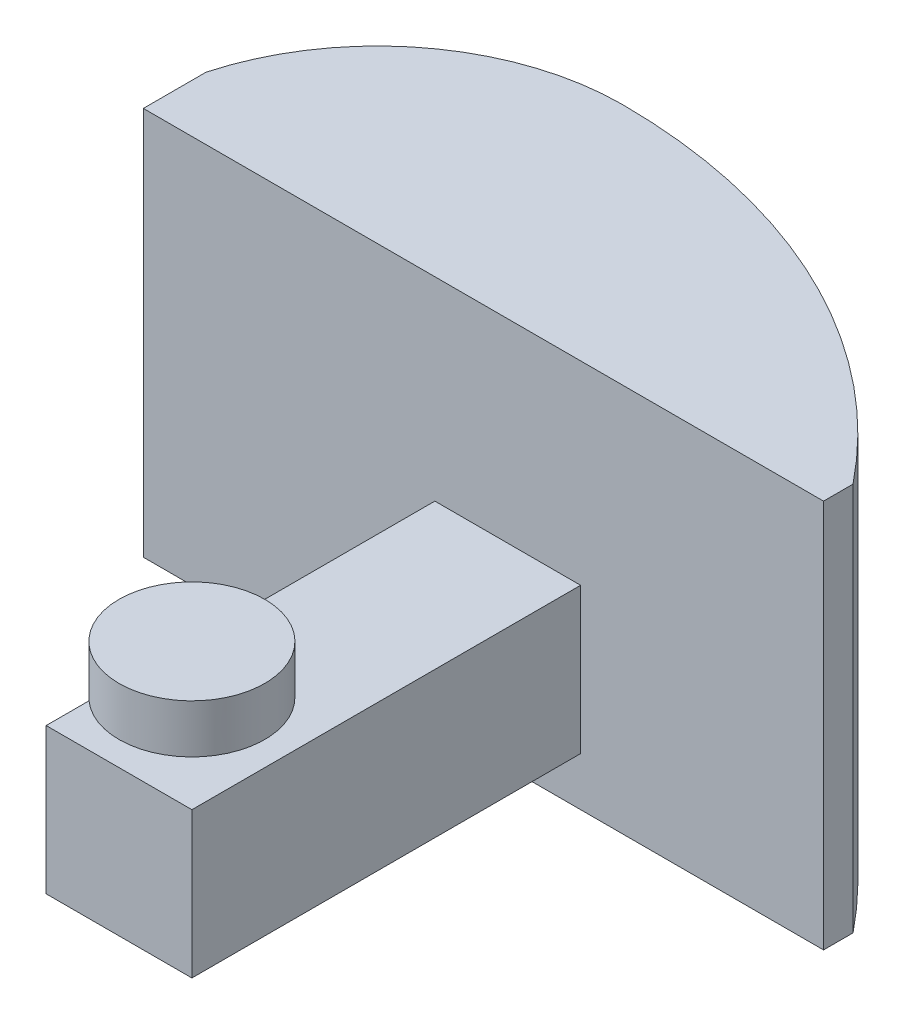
ISO-10303-21;
HEADER;
FILE_DESCRIPTION(('STEP AP214'),'2;1');
FILE_NAME('part.step','',(''),(''),'','','');
FILE_SCHEMA(('AUTOMOTIVE_DESIGN { 1 0 10303 214 1 1 1 1 }'));
ENDSEC;
DATA;
#1=APPLICATION_CONTEXT('core data for automotive mechanical design processes');
#2=APPLICATION_PROTOCOL_DEFINITION('international standard','automotive_design',2000,#1);
#3=PRODUCT_CONTEXT('',#1,'mechanical');
#4=PRODUCT('Part','Part','',(#3));
#5=PRODUCT_RELATED_PRODUCT_CATEGORY('part','',(#4));
#6=PRODUCT_DEFINITION_FORMATION('','',#4);
#7=PRODUCT_DEFINITION_CONTEXT('part definition',#1,'design');
#8=PRODUCT_DEFINITION('design','',#6,#7);
#9=PRODUCT_DEFINITION_SHAPE('','',#8);
#10=(LENGTH_UNIT() NAMED_UNIT(*) SI_UNIT(.MILLI.,.METRE.));
#11=(NAMED_UNIT(*) PLANE_ANGLE_UNIT() SI_UNIT($,.RADIAN.));
#12=(NAMED_UNIT(*) SI_UNIT($,.STERADIAN.) SOLID_ANGLE_UNIT());
#13=UNCERTAINTY_MEASURE_WITH_UNIT(LENGTH_MEASURE(1.E-05),#10,'distance_accuracy_value','');
#14=(GEOMETRIC_REPRESENTATION_CONTEXT(3) GLOBAL_UNCERTAINTY_ASSIGNED_CONTEXT((#13)) GLOBAL_UNIT_ASSIGNED_CONTEXT((#10,
#11,#12)) REPRESENTATION_CONTEXT('',''));
#15=CARTESIAN_POINT('',(0.,0.,0.));
#16=DIRECTION('',(0.,0.,1.));
#17=DIRECTION('',(1.,0.,0.));
#18=AXIS2_PLACEMENT_3D('',#15,#16,#17);
#19=CARTESIAN_POINT('',(-9.00000000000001,20.,8.));
#20=DIRECTION('',(0.,-1.,0.));
#21=DIRECTION('',(0.,0.,-1.));
#22=AXIS2_PLACEMENT_3D('',#19,#20,#21);
#23=PLANE('',#22);
#24=CARTESIAN_POINT('',(-8.00000000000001,20.,6.));
#25=DIRECTION('',(0.,-1.,0.));
#26=DIRECTION('',(0.,0.,-1.));
#27=AXIS2_PLACEMENT_3D('',#24,#25,#26);
#28=CIRCLE('',#27,1.5);
#29=CARTESIAN_POINT('',(-9.00000000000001,20.,7.11803398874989));
#30=VERTEX_POINT('',#29);
#31=CARTESIAN_POINT('',(-9.00000000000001,20.,4.88196601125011));
#32=VERTEX_POINT('',#31);
#33=EDGE_CURVE('E11',#30,#32,#28,.F.);
#34=ORIENTED_EDGE('',*,*,#33,.F.);
#35=DIRECTION('',(0.,0.,-1.));
#36=VECTOR('',#35,1.);
#37=CARTESIAN_POINT('',(-9.00000000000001,20.,8.));
#38=LINE('',#37,#36);
#39=CARTESIAN_POINT('',(-9.00000000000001,20.,8.));
#40=VERTEX_POINT('',#39);
#41=EDGE_CURVE('E119',#40,#30,#38,.T.);
#42=ORIENTED_EDGE('',*,*,#41,.F.);
#43=DIRECTION('',(-1.,0.,0.));
#44=VECTOR('',#43,1.);
#45=CARTESIAN_POINT('',(-9.00000000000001,20.,8.));
#46=LINE('',#45,#44);
#47=CARTESIAN_POINT('',(-6.00000000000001,20.,8.));
#48=VERTEX_POINT('',#47);
#49=EDGE_CURVE('E127',#48,#40,#46,.T.);
#50=ORIENTED_EDGE('',*,*,#49,.F.);
#51=DIRECTION('',(0.,0.,-1.));
#52=VECTOR('',#51,1.);
#53=CARTESIAN_POINT('',(-6.00000000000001,20.,8.));
#54=LINE('',#53,#52);
#55=CARTESIAN_POINT('',(-6.00000000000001,20.,0.));
#56=VERTEX_POINT('',#55);
#57=EDGE_CURVE('E196',#48,#56,#54,.T.);
#58=ORIENTED_EDGE('',*,*,#57,.T.);
#59=DIRECTION('',(-1.,0.,0.));
#60=VECTOR('',#59,1.);
#61=CARTESIAN_POINT('',(-9.00000000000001,20.,0.));
#62=LINE('',#61,#60);
#63=CARTESIAN_POINT('',(-9.00000000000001,20.,0.));
#64=VERTEX_POINT('',#63);
#65=EDGE_CURVE('E126',#56,#64,#62,.T.);
#66=ORIENTED_EDGE('',*,*,#65,.T.);
#67=EDGE_CURVE('E116',#32,#64,#38,.T.);
#68=ORIENTED_EDGE('',*,*,#67,.F.);
#69=EDGE_LOOP('',(#34,#42,#50,#58,#66,#68));
#70=FACE_BOUND('',#69,.T.);
#71=ADVANCED_FACE('F32',(#70),#23,.F.);
#72=CARTESIAN_POINT('',(-9.00000000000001,20.,8.));
#73=DIRECTION('',(1.,0.,0.));
#74=DIRECTION('',(0.,0.,-1.));
#75=AXIS2_PLACEMENT_3D('',#72,#73,#74);
#76=PLANE('',#75);
#77=DIRECTION('',(0.,-1.,0.));
#78=VECTOR('',#77,1.);
#79=CARTESIAN_POINT('',(-9.00000000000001,20.,0.));
#80=LINE('',#79,#78);
#81=CARTESIAN_POINT('',(-9.00000000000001,17.,0.));
#82=VERTEX_POINT('',#81);
#83=EDGE_CURVE('E179',#64,#82,#80,.T.);
#84=ORIENTED_EDGE('',*,*,#83,.T.);
#85=DIRECTION('',(0.,0.,-1.));
#86=VECTOR('',#85,1.);
#87=CARTESIAN_POINT('',(-9.00000000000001,17.,8.));
#88=LINE('',#87,#86);
#89=CARTESIAN_POINT('',(-9.00000000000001,17.,8.));
#90=VERTEX_POINT('',#89);
#91=EDGE_CURVE('E201',#90,#82,#88,.T.);
#92=ORIENTED_EDGE('',*,*,#91,.F.);
#93=DIRECTION('',(0.,-1.,0.));
#94=VECTOR('',#93,1.);
#95=CARTESIAN_POINT('',(-9.00000000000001,20.,8.));
#96=LINE('',#95,#94);
#97=EDGE_CURVE('E188',#40,#90,#96,.T.);
#98=ORIENTED_EDGE('',*,*,#97,.F.);
#99=ORIENTED_EDGE('',*,*,#41,.T.);
#100=EDGE_CURVE('E114',#30,#32,#38,.T.);
#101=ORIENTED_EDGE('',*,*,#100,.T.);
#102=ORIENTED_EDGE('',*,*,#67,.T.);
#103=EDGE_LOOP('',(#84,#92,#98,#99,#101,#102));
#104=FACE_BOUND('',#103,.T.);
#105=ADVANCED_FACE('F34',(#104),#76,.F.);
#106=CARTESIAN_POINT('',(-9.00000000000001,17.,8.));
#107=DIRECTION('',(0.,1.,0.));
#108=DIRECTION('',(0.,0.,1.));
#109=AXIS2_PLACEMENT_3D('',#106,#107,#108);
#110=PLANE('',#109);
#111=DIRECTION('',(1.,0.,0.));
#112=VECTOR('',#111,1.);
#113=CARTESIAN_POINT('',(-9.00000000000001,17.,0.));
#114=LINE('',#113,#112);
#115=CARTESIAN_POINT('',(-6.00000000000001,17.,0.));
#116=VERTEX_POINT('',#115);
#117=EDGE_CURVE('E181',#82,#116,#114,.T.);
#118=ORIENTED_EDGE('',*,*,#117,.T.);
#119=DIRECTION('',(0.,0.,-1.));
#120=VECTOR('',#119,1.);
#121=CARTESIAN_POINT('',(-6.00000000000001,17.,8.));
#122=LINE('',#121,#120);
#123=CARTESIAN_POINT('',(-6.00000000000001,17.,8.));
#124=VERTEX_POINT('',#123);
#125=EDGE_CURVE('E198',#124,#116,#122,.T.);
#126=ORIENTED_EDGE('',*,*,#125,.F.);
#127=DIRECTION('',(1.,0.,0.));
#128=VECTOR('',#127,1.);
#129=CARTESIAN_POINT('',(-9.00000000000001,17.,8.));
#130=LINE('',#129,#128);
#131=EDGE_CURVE('E191',#90,#124,#130,.T.);
#132=ORIENTED_EDGE('',*,*,#131,.F.);
#133=ORIENTED_EDGE('',*,*,#91,.T.);
#134=EDGE_LOOP('',(#118,#126,#132,#133));
#135=FACE_BOUND('',#134,.T.);
#136=ADVANCED_FACE('F237',(#135),#110,.F.);
#137=CARTESIAN_POINT('',(-6.00000000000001,20.,8.));
#138=DIRECTION('',(-1.,0.,0.));
#139=DIRECTION('',(0.,-1.,0.));
#140=AXIS2_PLACEMENT_3D('',#137,#138,#139);
#141=PLANE('',#140);
#142=DIRECTION('',(0.,1.,0.));
#143=VECTOR('',#142,1.);
#144=CARTESIAN_POINT('',(-6.00000000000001,20.,0.));
#145=LINE('',#144,#143);
#146=EDGE_CURVE('E184',#116,#56,#145,.T.);
#147=ORIENTED_EDGE('',*,*,#146,.T.);
#148=ORIENTED_EDGE('',*,*,#57,.F.);
#149=DIRECTION('',(0.,1.,0.));
#150=VECTOR('',#149,1.);
#151=CARTESIAN_POINT('',(-6.00000000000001,20.,8.));
#152=LINE('',#151,#150);
#153=EDGE_CURVE('E193',#124,#48,#152,.T.);
#154=ORIENTED_EDGE('',*,*,#153,.F.);
#155=ORIENTED_EDGE('',*,*,#125,.T.);
#156=EDGE_LOOP('',(#147,#148,#154,#155));
#157=FACE_BOUND('',#156,.T.);
#158=ADVANCED_FACE('F244',(#157),#141,.F.);
#159=CARTESIAN_POINT('',(-9.00000000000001,17.,8.));
#160=DIRECTION('',(0.,0.,1.));
#161=DIRECTION('',(1.,0.,0.));
#162=AXIS2_PLACEMENT_3D('',#159,#160,#161);
#163=PLANE('',#162);
#164=ORIENTED_EDGE('',*,*,#97,.T.);
#165=ORIENTED_EDGE('',*,*,#131,.T.);
#166=ORIENTED_EDGE('',*,*,#153,.T.);
#167=ORIENTED_EDGE('',*,*,#49,.T.);
#168=EDGE_LOOP('',(#164,#165,#166,#167));
#169=FACE_BOUND('',#168,.T.);
#170=ADVANCED_FACE('F233',(#169),#163,.T.);
#171=CARTESIAN_POINT('',(-15.,16.,0.));
#172=DIRECTION('',(0.,0.,1.));
#173=DIRECTION('',(1.,0.,0.));
#174=AXIS2_PLACEMENT_3D('',#171,#172,#173);
#175=PLANE('',#174);
#176=DIRECTION('',(0.,1.,0.));
#177=VECTOR('',#176,1.);
#178=CARTESIAN_POINT('',(-15.,24.,0.));
#179=LINE('',#178,#177);
#180=CARTESIAN_POINT('',(-15.,16.,0.));
#181=VERTEX_POINT('',#180);
#182=CARTESIAN_POINT('',(-15.,24.,0.));
#183=VERTEX_POINT('',#182);
#184=EDGE_CURVE('E149',#181,#183,#179,.T.);
#185=ORIENTED_EDGE('',*,*,#184,.F.);
#186=DIRECTION('',(-1.,0.,0.));
#187=VECTOR('',#186,1.);
#188=CARTESIAN_POINT('',(-15.,16.,0.));
#189=LINE('',#188,#187);
#190=CARTESIAN_POINT('',(-1.00000000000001,16.,0.));
#191=VERTEX_POINT('',#190);
#192=EDGE_CURVE('E162',#191,#181,#189,.T.);
#193=ORIENTED_EDGE('',*,*,#192,.F.);
#194=DIRECTION('',(0.,-1.,0.));
#195=VECTOR('',#194,1.);
#196=CARTESIAN_POINT('',(-1.00000000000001,24.,0.));
#197=LINE('',#196,#195);
#198=CARTESIAN_POINT('',(-1.00000000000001,24.,0.));
#199=VERTEX_POINT('',#198);
#200=EDGE_CURVE('E159',#199,#191,#197,.T.);
#201=ORIENTED_EDGE('',*,*,#200,.F.);
#202=DIRECTION('',(1.,0.,0.));
#203=VECTOR('',#202,1.);
#204=CARTESIAN_POINT('',(-15.,24.,0.));
#205=LINE('',#204,#203);
#206=EDGE_CURVE('E156',#183,#199,#205,.T.);
#207=ORIENTED_EDGE('',*,*,#206,.F.);
#208=EDGE_LOOP('',(#185,#193,#201,#207));
#209=FACE_BOUND('',#208,.T.);
#210=ORIENTED_EDGE('',*,*,#83,.F.);
#211=ORIENTED_EDGE('',*,*,#65,.F.);
#212=ORIENTED_EDGE('',*,*,#146,.F.);
#213=ORIENTED_EDGE('',*,*,#117,.F.);
#214=EDGE_LOOP('',(#210,#211,#212,#213));
#215=FACE_BOUND('',#214,.T.);
#216=ADVANCED_FACE('F230',(#209,#215),#175,.T.);
#217=CARTESIAN_POINT('',(-15.,24.,-5.));
#218=DIRECTION('',(1.,0.,0.));
#219=DIRECTION('',(0.,1.,0.));
#220=AXIS2_PLACEMENT_3D('',#217,#218,#219);
#221=PLANE('',#220);
#222=DIRECTION('',(0.,0.,1.));
#223=VECTOR('',#222,1.);
#224=CARTESIAN_POINT('',(-15.,24.,-5.));
#225=LINE('',#224,#223);
#226=CARTESIAN_POINT('',(-15.,24.,-1.29146303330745));
#227=VERTEX_POINT('',#226);
#228=EDGE_CURVE('E177',#227,#183,#225,.T.);
#229=ORIENTED_EDGE('',*,*,#228,.F.);
#230=DIRECTION('',(0.,-1.,0.));
#231=VECTOR('',#230,1.);
#232=CARTESIAN_POINT('',(-15.,24.,-1.29146303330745));
#233=LINE('',#232,#231);
#234=CARTESIAN_POINT('',(-15.,16.,-1.29146303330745));
#235=VERTEX_POINT('',#234);
#236=EDGE_CURVE('E146',#227,#235,#233,.T.);
#237=ORIENTED_EDGE('',*,*,#236,.T.);
#238=DIRECTION('',(0.,0.,1.));
#239=VECTOR('',#238,1.);
#240=CARTESIAN_POINT('',(-15.,16.,-5.));
#241=LINE('',#240,#239);
#242=EDGE_CURVE('E171',#235,#181,#241,.T.);
#243=ORIENTED_EDGE('',*,*,#242,.T.);
#244=ORIENTED_EDGE('',*,*,#184,.T.);
#245=EDGE_LOOP('',(#229,#237,#243,#244));
#246=FACE_BOUND('',#245,.T.);
#247=ADVANCED_FACE('F227',(#246),#221,.F.);
#248=CARTESIAN_POINT('',(-15.,24.,-5.));
#249=DIRECTION('',(0.,-1.,0.));
#250=DIRECTION('',(0.,0.,-1.));
#251=AXIS2_PLACEMENT_3D('',#248,#249,#250);
#252=PLANE('',#251);
#253=DIRECTION('',(1.,0.,0.));
#254=VECTOR('',#253,1.);
#255=CARTESIAN_POINT('',(-15.,24.,-5.));
#256=LINE('',#255,#254);
#257=CARTESIAN_POINT('',(-10.1474685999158,24.,-5.));
#258=VERTEX_POINT('',#257);
#259=CARTESIAN_POINT('',(-10.1248082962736,24.,-5.));
#260=VERTEX_POINT('',#259);
#261=EDGE_CURVE('E165',#258,#260,#256,.T.);
#262=ORIENTED_EDGE('',*,*,#261,.F.);
#263=CARTESIAN_POINT('',(-10.1361384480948,24.,0.043804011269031));
#264=DIRECTION('',(0.,1.,0.));
#265=DIRECTION('',(0.,0.,-1.));
#266=AXIS2_PLACEMENT_3D('',#263,#264,#265);
#267=CIRCLE('',#266,5.04381673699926);
#268=EDGE_CURVE('E140',#258,#227,#267,.T.);
#269=ORIENTED_EDGE('',*,*,#268,.T.);
#270=ORIENTED_EDGE('',*,*,#228,.T.);
#271=ORIENTED_EDGE('',*,*,#206,.T.);
#272=DIRECTION('',(0.,0.,1.));
#273=VECTOR('',#272,1.);
#274=CARTESIAN_POINT('',(-1.00000000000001,24.,-5.));
#275=LINE('',#274,#273);
#276=CARTESIAN_POINT('',(-1.,24.,-0.606488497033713));
#277=VERTEX_POINT('',#276);
#278=EDGE_CURVE('E175',#277,#199,#275,.T.);
#279=ORIENTED_EDGE('',*,*,#278,.F.);
#280=CARTESIAN_POINT('',(-10.1511513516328,24.,6.72704570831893));
#281=DIRECTION('',(0.,1.,0.));
#282=DIRECTION('',(0.,0.,1.));
#283=AXIS2_PLACEMENT_3D('',#280,#281,#282);
#284=CIRCLE('',#283,11.7270752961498);
#285=EDGE_CURVE('E143',#277,#260,#284,.T.);
#286=ORIENTED_EDGE('',*,*,#285,.T.);
#287=EDGE_LOOP('',(#262,#269,#270,#271,#279,#286));
#288=FACE_BOUND('',#287,.T.);
#289=ADVANCED_FACE('F211',(#288),#252,.F.);
#290=CARTESIAN_POINT('',(-1.00000000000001,24.,-5.));
#291=DIRECTION('',(-1.,0.,0.));
#292=DIRECTION('',(0.,-1.,0.));
#293=AXIS2_PLACEMENT_3D('',#290,#291,#292);
#294=PLANE('',#293);
#295=DIRECTION('',(0.,0.,1.));
#296=VECTOR('',#295,1.);
#297=CARTESIAN_POINT('',(-1.00000000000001,16.,-5.));
#298=LINE('',#297,#296);
#299=CARTESIAN_POINT('',(-1.,16.,-0.606488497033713));
#300=VERTEX_POINT('',#299);
#301=EDGE_CURVE('E173',#300,#191,#298,.T.);
#302=ORIENTED_EDGE('',*,*,#301,.F.);
#303=DIRECTION('',(0.,-1.,0.));
#304=VECTOR('',#303,1.);
#305=CARTESIAN_POINT('',(-1.,24.,-0.606488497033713));
#306=LINE('',#305,#304);
#307=EDGE_CURVE('E150',#277,#300,#306,.T.);
#308=ORIENTED_EDGE('',*,*,#307,.F.);
#309=ORIENTED_EDGE('',*,*,#278,.T.);
#310=ORIENTED_EDGE('',*,*,#200,.T.);
#311=EDGE_LOOP('',(#302,#308,#309,#310));
#312=FACE_BOUND('',#311,.T.);
#313=ADVANCED_FACE('F218',(#312),#294,.F.);
#314=CARTESIAN_POINT('',(-15.,16.,-5.));
#315=DIRECTION('',(0.,1.,0.));
#316=DIRECTION('',(0.,0.,1.));
#317=AXIS2_PLACEMENT_3D('',#314,#315,#316);
#318=PLANE('',#317);
#319=ORIENTED_EDGE('',*,*,#242,.F.);
#320=CARTESIAN_POINT('',(-10.1361384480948,16.,0.043804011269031));
#321=DIRECTION('',(0.,1.,0.));
#322=DIRECTION('',(0.,0.,-1.));
#323=AXIS2_PLACEMENT_3D('',#320,#321,#322);
#324=CIRCLE('',#323,5.04381673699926);
#325=CARTESIAN_POINT('',(-10.1474685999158,16.,-5.));
#326=VERTEX_POINT('',#325);
#327=EDGE_CURVE('E135',#326,#235,#324,.T.);
#328=ORIENTED_EDGE('',*,*,#327,.F.);
#329=DIRECTION('',(-1.,0.,0.));
#330=VECTOR('',#329,1.);
#331=CARTESIAN_POINT('',(-15.,16.,-5.));
#332=LINE('',#331,#330);
#333=CARTESIAN_POINT('',(-10.124808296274,16.,-5.));
#334=VERTEX_POINT('',#333);
#335=EDGE_CURVE('E168',#334,#326,#332,.T.);
#336=ORIENTED_EDGE('',*,*,#335,.F.);
#337=CARTESIAN_POINT('',(-10.1511513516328,16.,6.72704570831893));
#338=DIRECTION('',(0.,1.,0.));
#339=DIRECTION('',(0.,0.,1.));
#340=AXIS2_PLACEMENT_3D('',#337,#338,#339);
#341=CIRCLE('',#340,11.7270752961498);
#342=EDGE_CURVE('E53',#300,#334,#341,.T.);
#343=ORIENTED_EDGE('',*,*,#342,.F.);
#344=ORIENTED_EDGE('',*,*,#301,.T.);
#345=ORIENTED_EDGE('',*,*,#192,.T.);
#346=EDGE_LOOP('',(#319,#328,#336,#343,#344,#345));
#347=FACE_BOUND('',#346,.T.);
#348=ADVANCED_FACE('F223',(#347),#318,.F.);
#349=CARTESIAN_POINT('',(-15.,16.,-5.));
#350=DIRECTION('',(0.,0.,1.));
#351=DIRECTION('',(1.,0.,0.));
#352=AXIS2_PLACEMENT_3D('',#349,#350,#351);
#353=PLANE('',#352);
#354=ORIENTED_EDGE('',*,*,#335,.T.);
#355=DIRECTION('',(0.,-1.,0.));
#356=VECTOR('',#355,1.);
#357=CARTESIAN_POINT('',(-10.1474685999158,24.,-5.));
#358=LINE('',#357,#356);
#359=EDGE_CURVE('E40',#326,#258,#358,.F.);
#360=ORIENTED_EDGE('',*,*,#359,.T.);
#361=ORIENTED_EDGE('',*,*,#261,.T.);
#362=DIRECTION('',(0.,-1.,0.));
#363=VECTOR('',#362,1.);
#364=CARTESIAN_POINT('',(-10.1248082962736,24.,-5.));
#365=LINE('',#364,#363);
#366=EDGE_CURVE('E147',#260,#334,#365,.T.);
#367=ORIENTED_EDGE('',*,*,#366,.T.);
#368=EDGE_LOOP('',(#354,#360,#361,#367));
#369=FACE_BOUND('',#368,.T.);
#370=ADVANCED_FACE('F206',(#369),#353,.F.);
#371=CARTESIAN_POINT('',(-10.1511513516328,24.,6.72704570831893));
#372=DIRECTION('',(0.,-1.,0.));
#373=DIRECTION('',(0.,0.,-1.));
#374=AXIS2_PLACEMENT_3D('',#371,#372,#373);
#375=CYLINDRICAL_SURFACE('',#374,11.7270752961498);
#376=ORIENTED_EDGE('',*,*,#342,.T.);
#377=ORIENTED_EDGE('',*,*,#366,.F.);
#378=ORIENTED_EDGE('',*,*,#285,.F.);
#379=ORIENTED_EDGE('',*,*,#307,.T.);
#380=EDGE_LOOP('',(#376,#377,#378,#379));
#381=FACE_BOUND('',#380,.T.);
#382=ADVANCED_FACE('F215',(#381),#375,.T.);
#383=CARTESIAN_POINT('',(-10.1361384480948,24.,0.043804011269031));
#384=DIRECTION('',(0.,-1.,0.));
#385=DIRECTION('',(0.,0.,-1.));
#386=AXIS2_PLACEMENT_3D('',#383,#384,#385);
#387=CYLINDRICAL_SURFACE('',#386,5.04381673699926);
#388=ORIENTED_EDGE('',*,*,#327,.T.);
#389=ORIENTED_EDGE('',*,*,#236,.F.);
#390=ORIENTED_EDGE('',*,*,#268,.F.);
#391=ORIENTED_EDGE('',*,*,#359,.F.);
#392=EDGE_LOOP('',(#388,#389,#390,#391));
#393=FACE_BOUND('',#392,.T.);
#394=ADVANCED_FACE('F225',(#393),#387,.T.);
#395=CARTESIAN_POINT('',(-8.00000000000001,20.,6.));
#396=DIRECTION('',(0.,1.,0.));
#397=DIRECTION('',(0.,0.,1.));
#398=AXIS2_PLACEMENT_3D('',#395,#396,#397);
#399=PLANE('',#398);
#400=CARTESIAN_POINT('',(-8.00000000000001,20.,6.));
#401=DIRECTION('',(0.,1.,0.));
#402=DIRECTION('',(0.,0.,1.));
#403=AXIS2_PLACEMENT_3D('',#400,#401,#402);
#404=CIRCLE('',#403,1.5);
#405=EDGE_CURVE('E130',#32,#30,#404,.T.);
#406=ORIENTED_EDGE('',*,*,#405,.F.);
#407=ORIENTED_EDGE('',*,*,#100,.F.);
#408=EDGE_LOOP('',(#406,#407));
#409=FACE_BOUND('',#408,.T.);
#410=ADVANCED_FACE('F131',(#409),#399,.F.);
#411=CARTESIAN_POINT('',(-8.00000000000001,21.,6.));
#412=DIRECTION('',(0.,-1.,0.));
#413=DIRECTION('',(0.,0.,-1.));
#414=AXIS2_PLACEMENT_3D('',#411,#412,#413);
#415=CYLINDRICAL_SURFACE('',#414,1.5);
#416=CARTESIAN_POINT('',(-8.00000000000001,21.,6.));
#417=DIRECTION('',(0.,1.,0.));
#418=DIRECTION('',(0.,0.,1.));
#419=AXIS2_PLACEMENT_3D('',#416,#417,#418);
#420=CIRCLE('',#419,1.5);
#421=CARTESIAN_POINT('',(-8.00000000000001,21.,7.5));
#422=VERTEX_POINT('',#421);
#423=EDGE_CURVE('E132',#422,#422,#420,.T.);
#424=ORIENTED_EDGE('',*,*,#423,.F.);
#425=EDGE_LOOP('',(#424));
#426=FACE_BOUND('',#425,.T.);
#427=ORIENTED_EDGE('',*,*,#405,.T.);
#428=ORIENTED_EDGE('',*,*,#33,.T.);
#429=EDGE_LOOP('',(#427,#428));
#430=FACE_BOUND('',#429,.T.);
#431=ADVANCED_FACE('F129',(#426,#430),#415,.T.);
#432=CARTESIAN_POINT('',(-8.00000000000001,21.,6.));
#433=DIRECTION('',(0.,1.,0.));
#434=DIRECTION('',(0.,0.,1.));
#435=AXIS2_PLACEMENT_3D('',#432,#433,#434);
#436=PLANE('',#435);
#437=ORIENTED_EDGE('',*,*,#423,.T.);
#438=EDGE_LOOP('',(#437));
#439=FACE_BOUND('',#438,.T.);
#440=ADVANCED_FACE('F274',(#439),#436,.T.);
#441=CLOSED_SHELL('',(#71,#105,#136,#158,#170,#216,#247,#289,#313,#348,#370,#382,#394,#410,#431,#440));
#442=MANIFOLD_SOLID_BREP('B2',#441);
#443=ADVANCED_BREP_SHAPE_REPRESENTATION('',(#18,#442),#14);
#444=SHAPE_DEFINITION_REPRESENTATION(#9,#443);
ENDSEC;
END-ISO-10303-21;
